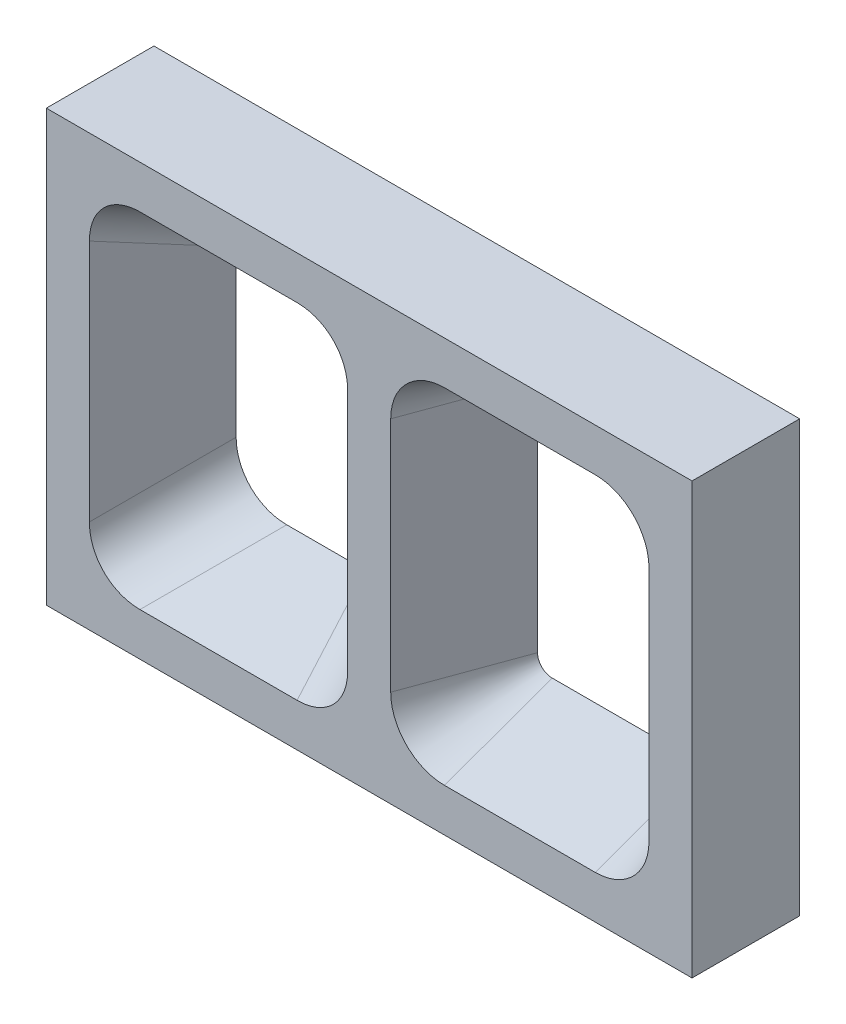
from build123d import *

# Parameters (mm, degrees)
SKETCH1_W                    = 76.2
SKETCH1_H                    = 50.8
EXTRUDE1_DEPTH               = 12.7
SKETCH2_W                    = 30.48
SKETCH2_H                    = 40.64
CUT_EXTRUDE1_DEPTH           = 12.7
CUT_EXTRUDE1_DRAFT           = -20
CUT_EXTRUDE1_PROFILE_2_DEPTH = 12.7
CUT_EXTRUDE1_PROFILE_2_DRAFT = -20
FILLET1_R                    = 6.35


with BuildPart() as part:
    # Sketch1 → Extrude1 (new body)
    with BuildSketch(Plane.XY):
        with Locations((38.1, 25.4)):
            Rectangle(SKETCH1_W, SKETCH1_H)
    extrude(amount=EXTRUDE1_DEPTH)


with BuildPart() as cut_extrude1_tool:
    # Sketch2 → Cut-Extrude1 (with draft: the straight prism first)
    with BuildSketch(Plane.XY.offset(12.7)):
        with Locations((20.32, 25.4)):
            Rectangle(SKETCH2_W, SKETCH2_H)
    extrude(amount=-CUT_EXTRUDE1_DEPTH)
    # Cut-Extrude1: the draft: its side faces are tilted about the plane it starts from
    cut_extrude1_sides = [cut_extrude1_tool.faces().sort_by_distance(p)[0] for p in [
        (20.32, 45.72, 6.35),
        (5.08, 25.4, 6.35),
        (20.32, 5.08, 6.35),
        (35.56, 25.4, 6.35),
    ]]
    draft(cut_extrude1_sides, Plane.XY.offset(12.7), CUT_EXTRUDE1_DRAFT)


with BuildPart() as part_1:
    add(part.part)

    # Cut-Extrude1: cut by cut_extrude1_tool
    add(cut_extrude1_tool.part, mode=Mode.SUBTRACT)


with BuildPart() as cut_extrude1_profile_2_tool:
    # Sketch2 → Cut-Extrude1 profile 2 (with draft: the straight prism first)
    with BuildSketch(Plane.XY.offset(12.7)):
        with BuildLine():
            Line((40.64, 39.37), (40.64, 11.43))
            ThreePointArc((40.64, 11.43), (42.499871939, 6.939871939), (46.99, 5.08))
            Line((46.99, 5.08), (64.77, 5.08))
            ThreePointArc((64.77, 5.08), (69.260128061, 6.939871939), (71.12, 11.43))
            Line((71.12, 11.43), (71.12, 39.37))
            ThreePointArc((71.12, 39.37), (69.260128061, 43.860128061), (64.77, 45.72))
            Line((64.77, 45.72), (46.99, 45.72))
            ThreePointArc((46.99, 45.72), (42.499871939, 43.860128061), (40.64, 39.37))
        make_face()
    extrude(amount=-CUT_EXTRUDE1_PROFILE_2_DEPTH)
    # Cut-Extrude1 profile 2: the draft: its side faces are tilted about the plane it starts from
    cut_extrude1_profile_2_sides = [cut_extrude1_profile_2_tool.faces().sort_by_distance(p)[0] for p in [
        (40.64, 25.4, 6.35),
        (42.499871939, 6.939871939, 6.35),
        (55.88, 5.08, 6.35),
        (69.260128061, 6.939871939, 6.35),
        (71.12, 25.4, 6.35),
        (69.260128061, 43.860128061, 6.35),
        (55.88, 45.72, 6.35),
        (42.499871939, 43.860128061, 6.35),
    ]]
    draft(cut_extrude1_profile_2_sides, Plane.XY.offset(12.7), CUT_EXTRUDE1_PROFILE_2_DRAFT)


with BuildPart() as part_2:
    add(part_1.part)

    # Cut-Extrude1 profile 2: cut by cut_extrude1_profile_2_tool
    add(cut_extrude1_profile_2_tool.part, mode=Mode.SUBTRACT)

    # Fillet1
    fillet1_edges = [part_2.edges().sort_by_distance(p)[0] for p in [
        (7.391210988, 43.408789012, 6.35),
        (33.248789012, 43.408789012, 6.35),
        (33.248789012, 7.391210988, 6.35),
        (7.391210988, 7.391210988, 6.35),
    ]]
    fillet(fillet1_edges, radius=FILLET1_R)


solid = part_2.part
